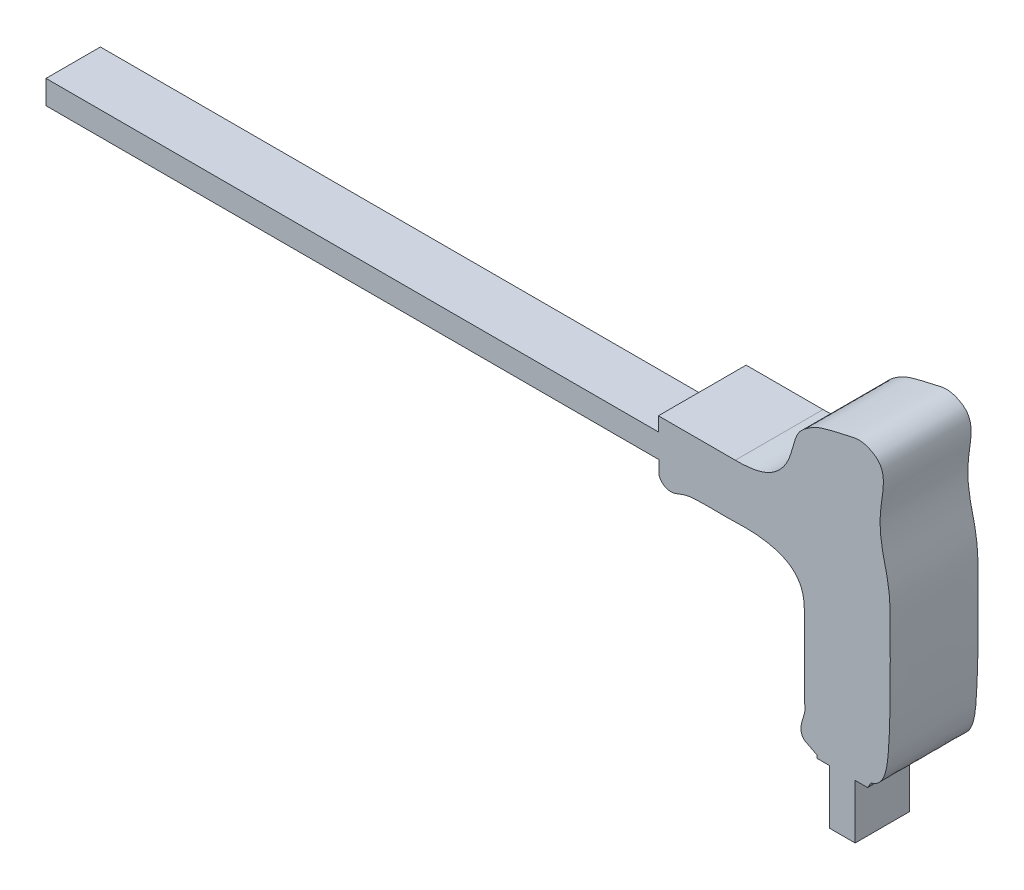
ISO-10303-21;
HEADER;
FILE_DESCRIPTION(('STEP AP214'),'2;1');
FILE_NAME('part.step','',(''),(''),'','','');
FILE_SCHEMA(('AUTOMOTIVE_DESIGN { 1 0 10303 214 1 1 1 1 }'));
ENDSEC;
DATA;
#1=APPLICATION_CONTEXT('core data for automotive mechanical design processes');
#2=APPLICATION_PROTOCOL_DEFINITION('international standard','automotive_design',2000,#1);
#3=PRODUCT_CONTEXT('',#1,'mechanical');
#4=PRODUCT('Part','Part','',(#3));
#5=PRODUCT_RELATED_PRODUCT_CATEGORY('part','',(#4));
#6=PRODUCT_DEFINITION_FORMATION('','',#4);
#7=PRODUCT_DEFINITION_CONTEXT('part definition',#1,'design');
#8=PRODUCT_DEFINITION('design','',#6,#7);
#9=PRODUCT_DEFINITION_SHAPE('','',#8);
#10=(LENGTH_UNIT() NAMED_UNIT(*) SI_UNIT(.MILLI.,.METRE.));
#11=(NAMED_UNIT(*) PLANE_ANGLE_UNIT() SI_UNIT($,.RADIAN.));
#12=(NAMED_UNIT(*) SI_UNIT($,.STERADIAN.) SOLID_ANGLE_UNIT());
#13=UNCERTAINTY_MEASURE_WITH_UNIT(LENGTH_MEASURE(1.E-05),#10,'distance_accuracy_value','');
#14=(GEOMETRIC_REPRESENTATION_CONTEXT(3) GLOBAL_UNCERTAINTY_ASSIGNED_CONTEXT((#13)) GLOBAL_UNIT_ASSIGNED_CONTEXT((#10,
#11,#12)) REPRESENTATION_CONTEXT('',''));
#15=CARTESIAN_POINT('',(0.,0.,0.));
#16=DIRECTION('',(0.,0.,1.));
#17=DIRECTION('',(1.,0.,0.));
#18=AXIS2_PLACEMENT_3D('',#15,#16,#17);
#19=CARTESIAN_POINT('',(249.403808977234,89.7026775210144,-12.5));
#20=DIRECTION('',(0.,0.,-1.));
#21=DIRECTION('',(-1.,0.,0.));
#22=AXIS2_PLACEMENT_3D('',#19,#20,#21);
#23=PLANE('',#22);
#24=DIRECTION('',(0.522562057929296,0.852601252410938,0.));
#25=VECTOR('',#24,1.);
#26=CARTESIAN_POINT('',(246.846245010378,24.4904508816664,-12.5));
#27=LINE('',#26,#25);
#28=CARTESIAN_POINT('',(245.846148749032,22.8587148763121,-12.5));
#29=VERTEX_POINT('',#28);
#30=CARTESIAN_POINT('',(246.846245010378,24.4904508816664,-12.5));
#31=VERTEX_POINT('',#30);
#32=EDGE_CURVE('E261',#29,#31,#27,.T.);
#33=ORIENTED_EDGE('',*,*,#32,.F.);
#34=DIRECTION('',(1.,0.,0.));
#35=VECTOR('',#34,1.);
#36=CARTESIAN_POINT('',(235.073876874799,22.8587148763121,-12.5));
#37=LINE('',#36,#35);
#38=CARTESIAN_POINT('',(231.488323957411,22.8587148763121,-12.5));
#39=VERTEX_POINT('',#38);
#40=EDGE_CURVE('E280',#39,#29,#37,.T.);
#41=ORIENTED_EDGE('',*,*,#40,.F.);
#42=DIRECTION('',(0.,-1.,0.));
#43=VECTOR('',#42,1.);
#44=CARTESIAN_POINT('',(231.488323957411,22.8587148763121,-12.5));
#45=LINE('',#44,#43);
#46=CARTESIAN_POINT('',(231.488323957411,23.6745828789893,-12.5));
#47=VERTEX_POINT('',#46);
#48=EDGE_CURVE('E414',#47,#39,#45,.T.);
#49=ORIENTED_EDGE('',*,*,#48,.F.);
#50=DIRECTION('',(0.891593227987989,-0.452837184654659,0.));
#51=VECTOR('',#50,1.);
#52=CARTESIAN_POINT('',(231.488323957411,23.6745828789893,-12.5));
#53=LINE('',#52,#51);
#54=CARTESIAN_POINT('',(228.065922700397,25.4128089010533,-12.5));
#55=VERTEX_POINT('',#54);
#56=EDGE_CURVE('E406',#55,#47,#53,.T.);
#57=ORIENTED_EDGE('',*,*,#56,.F.);
#58=CARTESIAN_POINT('',(227.857241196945,34.807233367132,-12.5));
#59=CARTESIAN_POINT('',(228.554159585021,32.3711469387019,-12.5));
#60=CARTESIAN_POINT('',(226.189140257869,29.4262759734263,-12.5));
#61=CARTESIAN_POINT('',(227.180498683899,25.9606999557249,-12.5));
#62=CARTESIAN_POINT('',(228.065922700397,25.4128089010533,-12.5));
#63=B_SPLINE_CURVE_WITH_KNOTS('',3,(#58,#59,#60,#61,#62),.UNSPECIFIED.,.F.,.F.,(4,1,4),(0.,
0.703509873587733,1.),.UNSPECIFIED.);
#64=CARTESIAN_POINT('',(227.857241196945,34.807233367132,-12.5));
#65=VERTEX_POINT('',#64);
#66=EDGE_CURVE('E399',#65,#55,#63,.T.);
#67=ORIENTED_EDGE('',*,*,#66,.F.);
#68=DIRECTION('',(0.,-1.,0.));
#69=VECTOR('',#68,1.);
#70=CARTESIAN_POINT('',(227.857241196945,53.8330800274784,-12.5));
#71=LINE('',#70,#69);
#72=CARTESIAN_POINT('',(227.857241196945,53.8330800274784,-12.5));
#73=VERTEX_POINT('',#72);
#74=EDGE_CURVE('E407',#73,#65,#71,.T.);
#75=ORIENTED_EDGE('',*,*,#74,.F.);
#76=CARTESIAN_POINT('',(201.714958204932,69.5182716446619,-12.5));
#77=CARTESIAN_POINT('',(205.529489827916,69.3219352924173,-12.5));
#78=CARTESIAN_POINT('',(211.380523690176,69.9539832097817,-12.5));
#79=CARTESIAN_POINT('',(218.581604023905,68.9657332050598,-12.5));
#80=CARTESIAN_POINT('',(223.046807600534,67.378708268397,-12.5));
#81=CARTESIAN_POINT('',(225.9091814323,64.9714087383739,-12.5));
#82=CARTESIAN_POINT('',(228.190350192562,60.4216522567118,-12.5));
#83=CARTESIAN_POINT('',(227.815743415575,56.4830538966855,-12.5));
#84=CARTESIAN_POINT('',(227.857241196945,53.8330800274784,-12.5));
#85=B_SPLINE_CURVE_WITH_KNOTS('',3,(#76,#77,#78,#79,#80,#81,#82,#83,#84),.UNSPECIFIED.,.F.,.F.,
(4,1,1,1,1,1,4),(0.,0.312765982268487,0.47819065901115,0.591351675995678,0.696911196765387,
0.775100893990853,1.),.UNSPECIFIED.);
#86=CARTESIAN_POINT('',(201.714958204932,69.5182716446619,-12.5));
#87=VERTEX_POINT('',#86);
#88=EDGE_CURVE('E325',#87,#73,#85,.T.);
#89=ORIENTED_EDGE('',*,*,#88,.F.);
#90=CARTESIAN_POINT('',(186.444976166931,70.2259582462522,-12.5));
#91=CARTESIAN_POINT('',(186.830198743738,68.7817302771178,-12.5));
#92=CARTESIAN_POINT('',(189.396498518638,67.2011722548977,-12.5));
#93=CARTESIAN_POINT('',(192.28049529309,68.5329586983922,-12.5));
#94=CARTESIAN_POINT('',(196.136505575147,69.7507859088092,-12.5));
#95=CARTESIAN_POINT('',(199.300789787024,69.4259606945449,-12.5));
#96=CARTESIAN_POINT('',(201.714958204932,69.5182716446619,-12.5));
#97=B_SPLINE_CURVE_WITH_KNOTS('',3,(#90,#91,#92,#93,#94,#95,#96),.UNSPECIFIED.,.F.,.F.,(4,1,1,1,
4),(0.,0.259940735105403,0.446406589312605,0.552011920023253,1.),.UNSPECIFIED.);
#98=CARTESIAN_POINT('',(186.444976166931,70.2259582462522,-12.5));
#99=VERTEX_POINT('',#98);
#100=EDGE_CURVE('E318',#99,#87,#97,.T.);
#101=ORIENTED_EDGE('',*,*,#100,.F.);
#102=DIRECTION('',(0.,-1.,0.));
#103=VECTOR('',#102,1.);
#104=CARTESIAN_POINT('',(186.444976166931,74.0533550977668,-12.5));
#105=LINE('',#104,#103);
#106=CARTESIAN_POINT('',(186.444976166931,74.0533550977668,-12.5));
#107=VERTEX_POINT('',#106);
#108=EDGE_CURVE('E314',#107,#99,#105,.T.);
#109=ORIENTED_EDGE('',*,*,#108,.F.);
#110=DIRECTION('',(-0.0285432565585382,0.999592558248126,0.));
#111=VECTOR('',#110,1.);
#112=CARTESIAN_POINT('',(186.252017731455,80.810811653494,-12.5));
#113=LINE('',#112,#111);
#114=CARTESIAN_POINT('',(186.252017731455,80.810811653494,-12.5));
#115=VERTEX_POINT('',#114);
#116=EDGE_CURVE('E433',#107,#115,#113,.T.);
#117=ORIENTED_EDGE('',*,*,#116,.T.);
#118=DIRECTION('',(0.,-1.,0.));
#119=VECTOR('',#118,1.);
#120=CARTESIAN_POINT('',(186.252017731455,80.810811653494,-12.5));
#121=LINE('',#120,#119);
#122=CARTESIAN_POINT('',(186.252017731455,84.7939748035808,-12.5));
#123=VERTEX_POINT('',#122);
#124=EDGE_CURVE('E311',#123,#115,#121,.T.);
#125=ORIENTED_EDGE('',*,*,#124,.F.);
#126=DIRECTION('',(-1.,0.,0.));
#127=VECTOR('',#126,1.);
#128=CARTESIAN_POINT('',(186.252017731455,84.7939748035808,-12.5));
#129=LINE('',#128,#127);
#130=CARTESIAN_POINT('',(208.169740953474,84.7939748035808,-12.5));
#131=VERTEX_POINT('',#130);
#132=EDGE_CURVE('E254',#131,#123,#129,.T.);
#133=ORIENTED_EDGE('',*,*,#132,.F.);
#134=CARTESIAN_POINT('',(246.846245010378,24.4904508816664,-12.5));
#135=CARTESIAN_POINT('',(249.541350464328,25.1449536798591,-12.5));
#136=CARTESIAN_POINT('',(251.321750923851,29.1759371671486,-12.5));
#137=CARTESIAN_POINT('',(252.006376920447,36.8949120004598,-12.5));
#138=CARTESIAN_POINT('',(252.279225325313,44.9508019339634,-12.5));
#139=CARTESIAN_POINT('',(252.375111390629,53.5484908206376,-12.5));
#140=CARTESIAN_POINT('',(252.249628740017,62.1713813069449,-12.5));
#141=CARTESIAN_POINT('',(252.489052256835,69.7244205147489,-12.5));
#142=CARTESIAN_POINT('',(251.73363636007,76.6308254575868,-12.5));
#143=CARTESIAN_POINT('',(250.455225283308,81.5328226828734,-12.5));
#144=CARTESIAN_POINT('',(249.485743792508,86.5917521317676,-12.5));
#145=CARTESIAN_POINT('',(249.27625752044,91.8665258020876,-12.5));
#146=CARTESIAN_POINT('',(250.051953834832,96.3900079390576,-12.5));
#147=CARTESIAN_POINT('',(250.444664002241,100.175824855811,-12.5));
#148=CARTESIAN_POINT('',(250.2170714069,102.968126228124,-12.5));
#149=CARTESIAN_POINT('',(248.994135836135,105.182106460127,-12.5));
#150=CARTESIAN_POINT('',(246.715346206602,106.717748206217,-12.5));
#151=CARTESIAN_POINT('',(243.634586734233,107.700482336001,-12.5));
#152=CARTESIAN_POINT('',(239.956695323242,106.79386594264,-12.5));
#153=CARTESIAN_POINT('',(236.424450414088,106.030582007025,-12.5));
#154=CARTESIAN_POINT('',(233.426238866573,105.239518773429,-12.5));
#155=CARTESIAN_POINT('',(230.830750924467,104.325102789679,-12.5));
#156=CARTESIAN_POINT('',(228.687748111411,102.997570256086,-12.5));
#157=CARTESIAN_POINT('',(226.196774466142,100.990119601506,-12.5));
#158=CARTESIAN_POINT('',(224.888427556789,97.7799214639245,-12.5));
#159=CARTESIAN_POINT('',(224.059332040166,94.0599027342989,-12.5));
#160=CARTESIAN_POINT('',(222.148266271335,89.802209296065,-12.5));
#161=CARTESIAN_POINT('',(217.031270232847,85.2220023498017,-12.5));
#162=CARTESIAN_POINT('',(211.440919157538,84.799959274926,-12.5));
#163=CARTESIAN_POINT('',(208.169740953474,84.7939748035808,-12.5));
#164=B_SPLINE_CURVE_WITH_KNOTS('',3,(#134,#135,#136,#137,#138,#139,#140,#141,#142,#143,#144,
#145,#146,#147,#148,#149,#150,#151,#152,#153,#154,#155,#156,#157,#158,#159,#160,#161,#162,#163),
.UNSPECIFIED.,.F.,.F.,(4,1,1,1,1,1,1,1,1,1,1,1,1,1,1,1,1,1,1,1,1,1,1,1,1,1,1,4),(0.,
0.0540989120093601,0.0903756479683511,0.173806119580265,0.233113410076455,0.282095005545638,
0.365979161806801,0.401251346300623,0.436426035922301,0.478744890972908,0.515881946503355,
0.553282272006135,0.580679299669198,0.600836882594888,0.614477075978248,0.6354896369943,
0.660553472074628,0.683931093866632,0.718081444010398,0.74170176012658,0.752892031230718,
0.779260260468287,0.797612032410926,0.822984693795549,0.854013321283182,0.883148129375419,
0.925552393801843,1.),.UNSPECIFIED.);
#165=EDGE_CURVE('E257',#31,#131,#164,.T.);
#166=ORIENTED_EDGE('',*,*,#165,.F.);
#167=EDGE_LOOP('',(#33,#41,#49,#57,#67,#75,#89,#101,#109,#117,#125,#133,#166));
#168=FACE_BOUND('',#167,.T.);
#169=ADVANCED_FACE('F39',(#168),#23,.T.);
#170=CARTESIAN_POINT('',(186.252017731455,80.810811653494,-12.5));
#171=DIRECTION('',(-1.,0.,0.));
#172=DIRECTION('',(0.,0.,1.));
#173=AXIS2_PLACEMENT_3D('',#170,#171,#172);
#174=PLANE('',#173);
#175=DIRECTION('',(0.,0.,1.));
#176=VECTOR('',#175,1.);
#177=CARTESIAN_POINT('',(186.252017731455,80.810811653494,-12.5));
#178=LINE('',#177,#176);
#179=CARTESIAN_POINT('',(186.252017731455,80.810811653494,-3.));
#180=VERTEX_POINT('',#179);
#181=EDGE_CURVE('E43',#115,#180,#178,.T.);
#182=ORIENTED_EDGE('',*,*,#181,.T.);
#183=CARTESIAN_POINT('',(186.252017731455,80.810811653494,12.5));
#184=VERTEX_POINT('',#183);
#185=EDGE_CURVE('E252',#180,#184,#178,.T.);
#186=ORIENTED_EDGE('',*,*,#185,.T.);
#187=DIRECTION('',(0.,-1.,0.));
#188=VECTOR('',#187,1.);
#189=CARTESIAN_POINT('',(186.252017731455,80.810811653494,12.5));
#190=LINE('',#189,#188);
#191=CARTESIAN_POINT('',(186.252017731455,84.7939748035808,12.5));
#192=VERTEX_POINT('',#191);
#193=EDGE_CURVE('E422',#192,#184,#190,.T.);
#194=ORIENTED_EDGE('',*,*,#193,.F.);
#195=DIRECTION('',(0.,0.,1.));
#196=VECTOR('',#195,1.);
#197=CARTESIAN_POINT('',(186.252017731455,84.7939748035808,-12.5));
#198=LINE('',#197,#196);
#199=EDGE_CURVE('E11',#123,#192,#198,.T.);
#200=ORIENTED_EDGE('',*,*,#199,.F.);
#201=ORIENTED_EDGE('',*,*,#124,.T.);
#202=EDGE_LOOP('',(#182,#186,#194,#200,#201));
#203=FACE_BOUND('',#202,.T.);
#204=ADVANCED_FACE('F41',(#203),#174,.T.);
#205=CARTESIAN_POINT('',(186.252017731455,84.7939748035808,-12.5));
#206=DIRECTION('',(0.,1.,0.));
#207=DIRECTION('',(0.,0.,1.));
#208=AXIS2_PLACEMENT_3D('',#205,#206,#207);
#209=PLANE('',#208);
#210=ORIENTED_EDGE('',*,*,#199,.T.);
#211=DIRECTION('',(-1.,0.,0.));
#212=VECTOR('',#211,1.);
#213=CARTESIAN_POINT('',(186.252017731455,84.7939748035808,12.5));
#214=LINE('',#213,#212);
#215=CARTESIAN_POINT('',(208.169740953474,84.7939748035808,12.5));
#216=VERTEX_POINT('',#215);
#217=EDGE_CURVE('E299',#216,#192,#214,.T.);
#218=ORIENTED_EDGE('',*,*,#217,.F.);
#219=DIRECTION('',(0.,0.,1.));
#220=VECTOR('',#219,1.);
#221=CARTESIAN_POINT('',(208.169740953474,84.7939748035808,-12.5));
#222=LINE('',#221,#220);
#223=EDGE_CURVE('E49',#131,#216,#222,.T.);
#224=ORIENTED_EDGE('',*,*,#223,.F.);
#225=ORIENTED_EDGE('',*,*,#132,.T.);
#226=EDGE_LOOP('',(#210,#218,#224,#225));
#227=FACE_BOUND('',#226,.T.);
#228=ADVANCED_FACE('F365',(#227),#209,.T.);
#229=DIRECTION('',(0.,0.,1.));
#230=VECTOR('',#229,1.);
#231=SURFACE_OF_LINEAR_EXTRUSION('',#164,#230);
#232=ORIENTED_EDGE('',*,*,#223,.T.);
#233=CARTESIAN_POINT('',(246.846245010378,24.4904508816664,12.5));
#234=CARTESIAN_POINT('',(249.541350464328,25.1449536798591,12.5));
#235=CARTESIAN_POINT('',(251.321750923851,29.1759371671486,12.5));
#236=CARTESIAN_POINT('',(252.006376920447,36.8949120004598,12.5));
#237=CARTESIAN_POINT('',(252.279225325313,44.9508019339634,12.5));
#238=CARTESIAN_POINT('',(252.375111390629,53.5484908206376,12.5));
#239=CARTESIAN_POINT('',(252.249628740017,62.1713813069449,12.5));
#240=CARTESIAN_POINT('',(252.489052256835,69.7244205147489,12.5));
#241=CARTESIAN_POINT('',(251.73363636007,76.6308254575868,12.5));
#242=CARTESIAN_POINT('',(250.455225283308,81.5328226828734,12.5));
#243=CARTESIAN_POINT('',(249.485743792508,86.5917521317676,12.5));
#244=CARTESIAN_POINT('',(249.27625752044,91.8665258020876,12.5));
#245=CARTESIAN_POINT('',(250.051953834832,96.3900079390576,12.5));
#246=CARTESIAN_POINT('',(250.444664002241,100.175824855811,12.5));
#247=CARTESIAN_POINT('',(250.2170714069,102.968126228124,12.5));
#248=CARTESIAN_POINT('',(248.994135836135,105.182106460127,12.5));
#249=CARTESIAN_POINT('',(246.715346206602,106.717748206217,12.5));
#250=CARTESIAN_POINT('',(243.634586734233,107.700482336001,12.5));
#251=CARTESIAN_POINT('',(239.956695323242,106.79386594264,12.5));
#252=CARTESIAN_POINT('',(236.424450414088,106.030582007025,12.5));
#253=CARTESIAN_POINT('',(233.426238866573,105.239518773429,12.5));
#254=CARTESIAN_POINT('',(230.830750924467,104.325102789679,12.5));
#255=CARTESIAN_POINT('',(228.687748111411,102.997570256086,12.5));
#256=CARTESIAN_POINT('',(226.196774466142,100.990119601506,12.5));
#257=CARTESIAN_POINT('',(224.888427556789,97.7799214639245,12.5));
#258=CARTESIAN_POINT('',(224.059332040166,94.0599027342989,12.5));
#259=CARTESIAN_POINT('',(222.148266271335,89.802209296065,12.5));
#260=CARTESIAN_POINT('',(217.031270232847,85.2220023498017,12.5));
#261=CARTESIAN_POINT('',(211.440919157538,84.799959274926,12.5));
#262=CARTESIAN_POINT('',(208.169740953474,84.7939748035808,12.5));
#263=B_SPLINE_CURVE_WITH_KNOTS('',3,(#233,#234,#235,#236,#237,#238,#239,#240,#241,#242,#243,
#244,#245,#246,#247,#248,#249,#250,#251,#252,#253,#254,#255,#256,#257,#258,#259,#260,#261,#262),
.UNSPECIFIED.,.F.,.F.,(4,1,1,1,1,1,1,1,1,1,1,1,1,1,1,1,1,1,1,1,1,1,1,1,1,1,1,4),(0.,
0.0540989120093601,0.0903756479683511,0.173806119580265,0.233113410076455,0.282095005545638,
0.365979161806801,0.401251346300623,0.436426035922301,0.478744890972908,0.515881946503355,
0.553282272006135,0.580679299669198,0.600836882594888,0.614477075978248,0.6354896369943,
0.660553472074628,0.683931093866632,0.718081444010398,0.74170176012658,0.752892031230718,
0.779260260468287,0.797612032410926,0.822984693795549,0.854013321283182,0.883148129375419,
0.925552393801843,1.),.UNSPECIFIED.);
#264=CARTESIAN_POINT('',(246.846245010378,24.4904508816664,12.5));
#265=VERTEX_POINT('',#264);
#266=EDGE_CURVE('E296',#265,#216,#263,.T.);
#267=ORIENTED_EDGE('',*,*,#266,.F.);
#268=DIRECTION('',(0.,0.,1.));
#269=VECTOR('',#268,1.);
#270=CARTESIAN_POINT('',(246.846245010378,24.4904508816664,-12.5));
#271=LINE('',#270,#269);
#272=EDGE_CURVE('E270',#31,#265,#271,.T.);
#273=ORIENTED_EDGE('',*,*,#272,.F.);
#274=ORIENTED_EDGE('',*,*,#165,.T.);
#275=EDGE_LOOP('',(#232,#267,#273,#274));
#276=FACE_BOUND('',#275,.T.);
#277=ADVANCED_FACE('F370',(#276),#231,.T.);
#278=CARTESIAN_POINT('',(246.846245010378,24.4904508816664,-12.5));
#279=DIRECTION('',(0.852601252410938,-0.522562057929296,0.));
#280=DIRECTION('',(0.522562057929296,0.852601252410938,0.));
#281=AXIS2_PLACEMENT_3D('',#278,#279,#280);
#282=PLANE('',#281);
#283=ORIENTED_EDGE('',*,*,#272,.T.);
#284=DIRECTION('',(0.522562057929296,0.852601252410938,0.));
#285=VECTOR('',#284,1.);
#286=CARTESIAN_POINT('',(246.846245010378,24.4904508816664,12.5));
#287=LINE('',#286,#285);
#288=CARTESIAN_POINT('',(245.846148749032,22.8587148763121,12.5));
#289=VERTEX_POINT('',#288);
#290=EDGE_CURVE('E290',#289,#265,#287,.T.);
#291=ORIENTED_EDGE('',*,*,#290,.F.);
#292=DIRECTION('',(0.,0.,1.));
#293=VECTOR('',#292,1.);
#294=CARTESIAN_POINT('',(245.846148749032,22.8587148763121,-12.5));
#295=LINE('',#294,#293);
#296=EDGE_CURVE('E208',#29,#289,#295,.T.);
#297=ORIENTED_EDGE('',*,*,#296,.F.);
#298=ORIENTED_EDGE('',*,*,#32,.T.);
#299=EDGE_LOOP('',(#283,#291,#297,#298));
#300=FACE_BOUND('',#299,.T.);
#301=ADVANCED_FACE('F294',(#300),#282,.T.);
#302=CARTESIAN_POINT('',(245.846148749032,22.8587148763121,-12.5));
#303=DIRECTION('',(0.,-1.,0.));
#304=DIRECTION('',(0.,0.,-1.));
#305=AXIS2_PLACEMENT_3D('',#302,#303,#304);
#306=PLANE('',#305);
#307=ORIENTED_EDGE('',*,*,#296,.T.);
#308=DIRECTION('',(1.,0.,0.));
#309=VECTOR('',#308,1.);
#310=CARTESIAN_POINT('',(245.846148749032,22.8587148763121,12.5));
#311=LINE('',#310,#309);
#312=CARTESIAN_POINT('',(242.319493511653,22.8587148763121,12.5));
#313=VERTEX_POINT('',#312);
#314=EDGE_CURVE('E278',#313,#289,#311,.T.);
#315=ORIENTED_EDGE('',*,*,#314,.F.);
#316=DIRECTION('',(0.,0.,1.));
#317=VECTOR('',#316,1.);
#318=CARTESIAN_POINT('',(242.319493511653,22.8587148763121,-12.5));
#319=LINE('',#318,#317);
#320=CARTESIAN_POINT('',(242.319493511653,22.8587148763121,-3.));
#321=VERTEX_POINT('',#320);
#322=EDGE_CURVE('E204',#321,#313,#319,.T.);
#323=ORIENTED_EDGE('',*,*,#322,.F.);
#324=DIRECTION('',(-1.,0.,0.));
#325=VECTOR('',#324,1.);
#326=CARTESIAN_POINT('',(235.073876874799,22.8587148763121,-3.));
#327=LINE('',#326,#325);
#328=CARTESIAN_POINT('',(235.073876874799,22.8587148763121,-3.));
#329=VERTEX_POINT('',#328);
#330=EDGE_CURVE('E183',#321,#329,#327,.T.);
#331=ORIENTED_EDGE('',*,*,#330,.T.);
#332=DIRECTION('',(0.,0.,1.));
#333=VECTOR('',#332,1.);
#334=CARTESIAN_POINT('',(235.073876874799,22.8587148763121,-12.5));
#335=LINE('',#334,#333);
#336=CARTESIAN_POINT('',(235.073876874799,22.8587148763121,12.5));
#337=VERTEX_POINT('',#336);
#338=EDGE_CURVE('E210',#329,#337,#335,.T.);
#339=ORIENTED_EDGE('',*,*,#338,.T.);
#340=DIRECTION('',(1.,0.,0.));
#341=VECTOR('',#340,1.);
#342=CARTESIAN_POINT('',(235.073876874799,22.8587148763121,12.5));
#343=LINE('',#342,#341);
#344=CARTESIAN_POINT('',(231.488323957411,22.8587148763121,12.5));
#345=VERTEX_POINT('',#344);
#346=EDGE_CURVE('E486',#345,#337,#343,.T.);
#347=ORIENTED_EDGE('',*,*,#346,.F.);
#348=DIRECTION('',(0.,0.,1.));
#349=VECTOR('',#348,1.);
#350=CARTESIAN_POINT('',(231.488323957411,22.8587148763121,-12.5));
#351=LINE('',#350,#349);
#352=EDGE_CURVE('E216',#39,#345,#351,.T.);
#353=ORIENTED_EDGE('',*,*,#352,.F.);
#354=ORIENTED_EDGE('',*,*,#40,.T.);
#355=EDGE_LOOP('',(#307,#315,#323,#331,#339,#347,#353,#354));
#356=FACE_BOUND('',#355,.T.);
#357=ADVANCED_FACE('F277',(#356),#306,.T.);
#358=CARTESIAN_POINT('',(242.319493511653,22.8587148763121,-12.5));
#359=DIRECTION('',(1.,0.,0.));
#360=DIRECTION('',(0.,0.,-1.));
#361=AXIS2_PLACEMENT_3D('',#358,#359,#360);
#362=PLANE('',#361);
#363=DIRECTION('',(0.,1.,0.));
#364=VECTOR('',#363,1.);
#365=CARTESIAN_POINT('',(242.319493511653,7.39849725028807,-3.));
#366=LINE('',#365,#364);
#367=CARTESIAN_POINT('',(242.319493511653,7.39849725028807,-3.));
#368=VERTEX_POINT('',#367);
#369=EDGE_CURVE('E177',#368,#321,#366,.T.);
#370=ORIENTED_EDGE('',*,*,#369,.T.);
#371=ORIENTED_EDGE('',*,*,#322,.T.);
#372=DIRECTION('',(0.,1.,0.));
#373=VECTOR('',#372,1.);
#374=CARTESIAN_POINT('',(242.319493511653,22.8587148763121,12.5));
#375=LINE('',#374,#373);
#376=CARTESIAN_POINT('',(242.319493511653,7.39849725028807,12.5));
#377=VERTEX_POINT('',#376);
#378=EDGE_CURVE('E202',#377,#313,#375,.T.);
#379=ORIENTED_EDGE('',*,*,#378,.F.);
#380=DIRECTION('',(0.,0.,1.));
#381=VECTOR('',#380,1.);
#382=CARTESIAN_POINT('',(242.319493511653,7.39849725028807,-12.5));
#383=LINE('',#382,#381);
#384=EDGE_CURVE('E193',#368,#377,#383,.T.);
#385=ORIENTED_EDGE('',*,*,#384,.F.);
#386=EDGE_LOOP('',(#370,#371,#379,#385));
#387=FACE_BOUND('',#386,.T.);
#388=ADVANCED_FACE('F200',(#387),#362,.T.);
#389=CARTESIAN_POINT('',(242.319493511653,7.39849725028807,-12.5));
#390=DIRECTION('',(0.,-1.,0.));
#391=DIRECTION('',(0.,0.,-1.));
#392=AXIS2_PLACEMENT_3D('',#389,#390,#391);
#393=PLANE('',#392);
#394=DIRECTION('',(1.,0.,0.));
#395=VECTOR('',#394,1.);
#396=CARTESIAN_POINT('',(235.073876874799,7.39849725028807,-3.));
#397=LINE('',#396,#395);
#398=CARTESIAN_POINT('',(235.073876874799,7.39849725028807,-3.));
#399=VERTEX_POINT('',#398);
#400=EDGE_CURVE('E181',#399,#368,#397,.T.);
#401=ORIENTED_EDGE('',*,*,#400,.T.);
#402=ORIENTED_EDGE('',*,*,#384,.T.);
#403=DIRECTION('',(1.,0.,0.));
#404=VECTOR('',#403,1.);
#405=CARTESIAN_POINT('',(242.319493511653,7.39849725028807,12.5));
#406=LINE('',#405,#404);
#407=CARTESIAN_POINT('',(235.073876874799,7.39849725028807,12.5));
#408=VERTEX_POINT('',#407);
#409=EDGE_CURVE('E494',#408,#377,#406,.T.);
#410=ORIENTED_EDGE('',*,*,#409,.F.);
#411=DIRECTION('',(0.,0.,1.));
#412=VECTOR('',#411,1.);
#413=CARTESIAN_POINT('',(235.073876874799,7.39849725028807,-12.5));
#414=LINE('',#413,#412);
#415=EDGE_CURVE('E195',#399,#408,#414,.T.);
#416=ORIENTED_EDGE('',*,*,#415,.F.);
#417=EDGE_LOOP('',(#401,#402,#410,#416));
#418=FACE_BOUND('',#417,.T.);
#419=ADVANCED_FACE('F191',(#418),#393,.T.);
#420=CARTESIAN_POINT('',(235.073876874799,7.39849725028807,-12.5));
#421=DIRECTION('',(-1.,0.,0.));
#422=DIRECTION('',(0.,0.,1.));
#423=AXIS2_PLACEMENT_3D('',#420,#421,#422);
#424=PLANE('',#423);
#425=DIRECTION('',(0.,-1.,0.));
#426=VECTOR('',#425,1.);
#427=CARTESIAN_POINT('',(235.073876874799,22.8587148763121,-3.));
#428=LINE('',#427,#426);
#429=EDGE_CURVE('E425',#329,#399,#428,.T.);
#430=ORIENTED_EDGE('',*,*,#429,.T.);
#431=ORIENTED_EDGE('',*,*,#415,.T.);
#432=DIRECTION('',(0.,-1.,0.));
#433=VECTOR('',#432,1.);
#434=CARTESIAN_POINT('',(235.073876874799,7.39849725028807,12.5));
#435=LINE('',#434,#433);
#436=EDGE_CURVE('E490',#337,#408,#435,.T.);
#437=ORIENTED_EDGE('',*,*,#436,.F.);
#438=ORIENTED_EDGE('',*,*,#338,.F.);
#439=EDGE_LOOP('',(#430,#431,#437,#438));
#440=FACE_BOUND('',#439,.T.);
#441=ADVANCED_FACE('F382',(#440),#424,.T.);
#442=CARTESIAN_POINT('',(231.488323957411,22.8587148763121,-12.5));
#443=DIRECTION('',(-1.,0.,0.));
#444=DIRECTION('',(0.,0.,1.));
#445=AXIS2_PLACEMENT_3D('',#442,#443,#444);
#446=PLANE('',#445);
#447=ORIENTED_EDGE('',*,*,#352,.T.);
#448=DIRECTION('',(0.,-1.,0.));
#449=VECTOR('',#448,1.);
#450=CARTESIAN_POINT('',(231.488323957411,22.8587148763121,12.5));
#451=LINE('',#450,#449);
#452=CARTESIAN_POINT('',(231.488323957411,23.6745828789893,12.5));
#453=VERTEX_POINT('',#452);
#454=EDGE_CURVE('E482',#453,#345,#451,.T.);
#455=ORIENTED_EDGE('',*,*,#454,.F.);
#456=DIRECTION('',(0.,0.,1.));
#457=VECTOR('',#456,1.);
#458=CARTESIAN_POINT('',(231.488323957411,23.6745828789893,-12.5));
#459=LINE('',#458,#457);
#460=EDGE_CURVE('E219',#47,#453,#459,.T.);
#461=ORIENTED_EDGE('',*,*,#460,.F.);
#462=ORIENTED_EDGE('',*,*,#48,.T.);
#463=EDGE_LOOP('',(#447,#455,#461,#462));
#464=FACE_BOUND('',#463,.T.);
#465=ADVANCED_FACE('F385',(#464),#446,.T.);
#466=CARTESIAN_POINT('',(231.488323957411,23.6745828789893,-12.5));
#467=DIRECTION('',(-0.452837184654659,-0.891593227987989,0.));
#468=DIRECTION('',(0.891593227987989,-0.452837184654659,0.));
#469=AXIS2_PLACEMENT_3D('',#466,#467,#468);
#470=PLANE('',#469);
#471=ORIENTED_EDGE('',*,*,#460,.T.);
#472=DIRECTION('',(0.891593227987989,-0.452837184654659,0.));
#473=VECTOR('',#472,1.);
#474=CARTESIAN_POINT('',(231.488323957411,23.6745828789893,12.5));
#475=LINE('',#474,#473);
#476=CARTESIAN_POINT('',(228.065922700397,25.4128089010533,12.5));
#477=VERTEX_POINT('',#476);
#478=EDGE_CURVE('E475',#477,#453,#475,.T.);
#479=ORIENTED_EDGE('',*,*,#478,.F.);
#480=DIRECTION('',(0.,0.,1.));
#481=VECTOR('',#480,1.);
#482=CARTESIAN_POINT('',(228.065922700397,25.4128089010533,-12.5));
#483=LINE('',#482,#481);
#484=EDGE_CURVE('E222',#55,#477,#483,.T.);
#485=ORIENTED_EDGE('',*,*,#484,.F.);
#486=ORIENTED_EDGE('',*,*,#56,.T.);
#487=EDGE_LOOP('',(#471,#479,#485,#486));
#488=FACE_BOUND('',#487,.T.);
#489=ADVANCED_FACE('F389',(#488),#470,.T.);
#490=DIRECTION('',(0.,0.,1.));
#491=VECTOR('',#490,1.);
#492=SURFACE_OF_LINEAR_EXTRUSION('',#63,#491);
#493=ORIENTED_EDGE('',*,*,#484,.T.);
#494=CARTESIAN_POINT('',(227.857241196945,34.807233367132,12.5));
#495=CARTESIAN_POINT('',(228.554159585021,32.3711469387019,12.5));
#496=CARTESIAN_POINT('',(226.189140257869,29.4262759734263,12.5));
#497=CARTESIAN_POINT('',(227.180498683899,25.9606999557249,12.5));
#498=CARTESIAN_POINT('',(228.065922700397,25.4128089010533,12.5));
#499=B_SPLINE_CURVE_WITH_KNOTS('',3,(#494,#495,#496,#497,#498),.UNSPECIFIED.,.F.,.F.,(4,1,4),
(0.,0.703509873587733,1.),.UNSPECIFIED.);
#500=CARTESIAN_POINT('',(227.857241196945,34.807233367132,12.5));
#501=VERTEX_POINT('',#500);
#502=EDGE_CURVE('E469',#501,#477,#499,.T.);
#503=ORIENTED_EDGE('',*,*,#502,.F.);
#504=DIRECTION('',(0.,0.,1.));
#505=VECTOR('',#504,1.);
#506=CARTESIAN_POINT('',(227.857241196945,34.807233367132,-12.5));
#507=LINE('',#506,#505);
#508=EDGE_CURVE('E225',#65,#501,#507,.T.);
#509=ORIENTED_EDGE('',*,*,#508,.F.);
#510=ORIENTED_EDGE('',*,*,#66,.T.);
#511=EDGE_LOOP('',(#493,#503,#509,#510));
#512=FACE_BOUND('',#511,.T.);
#513=ADVANCED_FACE('F393',(#512),#492,.T.);
#514=CARTESIAN_POINT('',(227.857241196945,53.8330800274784,-12.5));
#515=DIRECTION('',(-1.,0.,0.));
#516=DIRECTION('',(0.,0.,1.));
#517=AXIS2_PLACEMENT_3D('',#514,#515,#516);
#518=PLANE('',#517);
#519=ORIENTED_EDGE('',*,*,#508,.T.);
#520=DIRECTION('',(0.,-1.,0.));
#521=VECTOR('',#520,1.);
#522=CARTESIAN_POINT('',(227.857241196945,53.8330800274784,12.5));
#523=LINE('',#522,#521);
#524=CARTESIAN_POINT('',(227.857241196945,53.8330800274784,12.5));
#525=VERTEX_POINT('',#524);
#526=EDGE_CURVE('E462',#525,#501,#523,.T.);
#527=ORIENTED_EDGE('',*,*,#526,.F.);
#528=DIRECTION('',(0.,0.,1.));
#529=VECTOR('',#528,1.);
#530=CARTESIAN_POINT('',(227.857241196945,53.8330800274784,-12.5));
#531=LINE('',#530,#529);
#532=EDGE_CURVE('E228',#73,#525,#531,.T.);
#533=ORIENTED_EDGE('',*,*,#532,.F.);
#534=ORIENTED_EDGE('',*,*,#74,.T.);
#535=EDGE_LOOP('',(#519,#527,#533,#534));
#536=FACE_BOUND('',#535,.T.);
#537=ADVANCED_FACE('F397',(#536),#518,.T.);
#538=DIRECTION('',(0.,0.,1.));
#539=VECTOR('',#538,1.);
#540=SURFACE_OF_LINEAR_EXTRUSION('',#85,#539);
#541=ORIENTED_EDGE('',*,*,#532,.T.);
#542=CARTESIAN_POINT('',(201.714958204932,69.5182716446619,12.5));
#543=CARTESIAN_POINT('',(205.529489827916,69.3219352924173,12.5));
#544=CARTESIAN_POINT('',(211.380523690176,69.9539832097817,12.5));
#545=CARTESIAN_POINT('',(218.581604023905,68.9657332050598,12.5));
#546=CARTESIAN_POINT('',(223.046807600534,67.378708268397,12.5));
#547=CARTESIAN_POINT('',(225.9091814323,64.9714087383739,12.5));
#548=CARTESIAN_POINT('',(228.190350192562,60.4216522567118,12.5));
#549=CARTESIAN_POINT('',(227.815743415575,56.4830538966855,12.5));
#550=CARTESIAN_POINT('',(227.857241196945,53.8330800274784,12.5));
#551=B_SPLINE_CURVE_WITH_KNOTS('',3,(#542,#543,#544,#545,#546,#547,#548,#549,#550),
.UNSPECIFIED.,.F.,.F.,(4,1,1,1,1,1,4),(0.,0.312765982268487,0.47819065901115,0.591351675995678,
0.696911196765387,0.775100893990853,1.),.UNSPECIFIED.);
#552=CARTESIAN_POINT('',(201.714958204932,69.5182716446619,12.5));
#553=VERTEX_POINT('',#552);
#554=EDGE_CURVE('E453',#553,#525,#551,.T.);
#555=ORIENTED_EDGE('',*,*,#554,.F.);
#556=DIRECTION('',(0.,0.,1.));
#557=VECTOR('',#556,1.);
#558=CARTESIAN_POINT('',(201.714958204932,69.5182716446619,-12.5));
#559=LINE('',#558,#557);
#560=EDGE_CURVE('E231',#87,#553,#559,.T.);
#561=ORIENTED_EDGE('',*,*,#560,.F.);
#562=ORIENTED_EDGE('',*,*,#88,.T.);
#563=EDGE_LOOP('',(#541,#555,#561,#562));
#564=FACE_BOUND('',#563,.T.);
#565=ADVANCED_FACE('F339',(#564),#540,.T.);
#566=DIRECTION('',(0.,0.,1.));
#567=VECTOR('',#566,1.);
#568=SURFACE_OF_LINEAR_EXTRUSION('',#97,#567);
#569=ORIENTED_EDGE('',*,*,#560,.T.);
#570=CARTESIAN_POINT('',(186.444976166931,70.2259582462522,12.5));
#571=CARTESIAN_POINT('',(186.830198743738,68.7817302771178,12.5));
#572=CARTESIAN_POINT('',(189.396498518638,67.2011722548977,12.5));
#573=CARTESIAN_POINT('',(192.28049529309,68.5329586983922,12.5));
#574=CARTESIAN_POINT('',(196.136505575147,69.7507859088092,12.5));
#575=CARTESIAN_POINT('',(199.300789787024,69.4259606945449,12.5));
#576=CARTESIAN_POINT('',(201.714958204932,69.5182716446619,12.5));
#577=B_SPLINE_CURVE_WITH_KNOTS('',3,(#570,#571,#572,#573,#574,#575,#576),.UNSPECIFIED.,.F.,.F.,
(4,1,1,1,4),(0.,0.259940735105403,0.446406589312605,0.552011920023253,1.),.UNSPECIFIED.);
#578=CARTESIAN_POINT('',(186.444976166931,70.2259582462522,12.5));
#579=VERTEX_POINT('',#578);
#580=EDGE_CURVE('E447',#579,#553,#577,.T.);
#581=ORIENTED_EDGE('',*,*,#580,.F.);
#582=DIRECTION('',(0.,0.,1.));
#583=VECTOR('',#582,1.);
#584=CARTESIAN_POINT('',(186.444976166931,70.2259582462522,-12.5));
#585=LINE('',#584,#583);
#586=EDGE_CURVE('E234',#99,#579,#585,.T.);
#587=ORIENTED_EDGE('',*,*,#586,.F.);
#588=ORIENTED_EDGE('',*,*,#100,.T.);
#589=EDGE_LOOP('',(#569,#581,#587,#588));
#590=FACE_BOUND('',#589,.T.);
#591=ADVANCED_FACE('F334',(#590),#568,.T.);
#592=CARTESIAN_POINT('',(186.444976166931,74.0533550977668,-12.5));
#593=DIRECTION('',(-1.,0.,0.));
#594=DIRECTION('',(0.,0.,1.));
#595=AXIS2_PLACEMENT_3D('',#592,#593,#594);
#596=PLANE('',#595);
#597=ORIENTED_EDGE('',*,*,#586,.T.);
#598=DIRECTION('',(0.,-1.,0.));
#599=VECTOR('',#598,1.);
#600=CARTESIAN_POINT('',(186.444976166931,74.0533550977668,12.5));
#601=LINE('',#600,#599);
#602=CARTESIAN_POINT('',(186.444976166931,74.0533550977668,12.5));
#603=VERTEX_POINT('',#602);
#604=EDGE_CURVE('E443',#603,#579,#601,.T.);
#605=ORIENTED_EDGE('',*,*,#604,.F.);
#606=DIRECTION('',(0.,0.,1.));
#607=VECTOR('',#606,1.);
#608=CARTESIAN_POINT('',(186.444976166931,74.0533550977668,-12.5));
#609=LINE('',#608,#607);
#610=CARTESIAN_POINT('',(186.444976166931,74.0533550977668,-3.));
#611=VERTEX_POINT('',#610);
#612=EDGE_CURVE('E240',#611,#603,#609,.T.);
#613=ORIENTED_EDGE('',*,*,#612,.F.);
#614=EDGE_CURVE('E237',#107,#611,#609,.T.);
#615=ORIENTED_EDGE('',*,*,#614,.F.);
#616=ORIENTED_EDGE('',*,*,#108,.T.);
#617=EDGE_LOOP('',(#597,#605,#613,#615,#616));
#618=FACE_BOUND('',#617,.T.);
#619=ADVANCED_FACE('F338',(#618),#596,.T.);
#620=CARTESIAN_POINT('',(11.7691688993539,74.0533550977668,-12.5));
#621=DIRECTION('',(0.,-1.,0.));
#622=DIRECTION('',(0.,0.,-1.));
#623=AXIS2_PLACEMENT_3D('',#620,#621,#622);
#624=PLANE('',#623);
#625=DIRECTION('',(1.,0.,0.));
#626=VECTOR('',#625,1.);
#627=CARTESIAN_POINT('',(11.7691688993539,74.0533550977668,-3.));
#628=LINE('',#627,#626);
#629=CARTESIAN_POINT('',(11.7691688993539,74.0533550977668,-3.));
#630=VERTEX_POINT('',#629);
#631=EDGE_CURVE('E507',#630,#611,#628,.T.);
#632=ORIENTED_EDGE('',*,*,#631,.T.);
#633=ORIENTED_EDGE('',*,*,#612,.T.);
#634=DIRECTION('',(1.,0.,0.));
#635=VECTOR('',#634,1.);
#636=CARTESIAN_POINT('',(11.7691688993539,74.0533550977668,12.5));
#637=LINE('',#636,#635);
#638=CARTESIAN_POINT('',(11.7691688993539,74.0533550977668,12.5));
#639=VERTEX_POINT('',#638);
#640=EDGE_CURVE('E439',#639,#603,#637,.T.);
#641=ORIENTED_EDGE('',*,*,#640,.F.);
#642=DIRECTION('',(0.,0.,1.));
#643=VECTOR('',#642,1.);
#644=CARTESIAN_POINT('',(11.7691688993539,74.0533550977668,-12.5));
#645=LINE('',#644,#643);
#646=EDGE_CURVE('E241',#630,#639,#645,.T.);
#647=ORIENTED_EDGE('',*,*,#646,.F.);
#648=EDGE_LOOP('',(#632,#633,#641,#647));
#649=FACE_BOUND('',#648,.T.);
#650=ADVANCED_FACE('F344',(#649),#624,.T.);
#651=CARTESIAN_POINT('',(11.7691688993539,80.810811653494,-12.5));
#652=DIRECTION('',(-1.,0.,0.));
#653=DIRECTION('',(0.,0.,1.));
#654=AXIS2_PLACEMENT_3D('',#651,#652,#653);
#655=PLANE('',#654);
#656=DIRECTION('',(0.,-1.,0.));
#657=VECTOR('',#656,1.);
#658=CARTESIAN_POINT('',(11.7691688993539,80.810811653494,-3.));
#659=LINE('',#658,#657);
#660=CARTESIAN_POINT('',(11.7691688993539,80.810811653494,-3.));
#661=VERTEX_POINT('',#660);
#662=EDGE_CURVE('E503',#661,#630,#659,.T.);
#663=ORIENTED_EDGE('',*,*,#662,.T.);
#664=ORIENTED_EDGE('',*,*,#646,.T.);
#665=DIRECTION('',(0.,-1.,0.));
#666=VECTOR('',#665,1.);
#667=CARTESIAN_POINT('',(11.7691688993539,80.810811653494,12.5));
#668=LINE('',#667,#666);
#669=CARTESIAN_POINT('',(11.7691688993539,80.810811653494,12.5));
#670=VERTEX_POINT('',#669);
#671=EDGE_CURVE('E429',#670,#639,#668,.T.);
#672=ORIENTED_EDGE('',*,*,#671,.F.);
#673=DIRECTION('',(0.,0.,1.));
#674=VECTOR('',#673,1.);
#675=CARTESIAN_POINT('',(11.7691688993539,80.810811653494,-12.5));
#676=LINE('',#675,#674);
#677=EDGE_CURVE('E243',#661,#670,#676,.T.);
#678=ORIENTED_EDGE('',*,*,#677,.F.);
#679=EDGE_LOOP('',(#663,#664,#672,#678));
#680=FACE_BOUND('',#679,.T.);
#681=ADVANCED_FACE('F348',(#680),#655,.T.);
#682=CARTESIAN_POINT('',(186.252017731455,80.810811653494,-12.5));
#683=DIRECTION('',(0.,1.,0.));
#684=DIRECTION('',(0.,0.,1.));
#685=AXIS2_PLACEMENT_3D('',#682,#683,#684);
#686=PLANE('',#685);
#687=DIRECTION('',(-1.,0.,0.));
#688=VECTOR('',#687,1.);
#689=CARTESIAN_POINT('',(186.252017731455,80.810811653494,-3.));
#690=LINE('',#689,#688);
#691=EDGE_CURVE('E197',#180,#661,#690,.T.);
#692=ORIENTED_EDGE('',*,*,#691,.T.);
#693=ORIENTED_EDGE('',*,*,#677,.T.);
#694=DIRECTION('',(-1.,0.,0.));
#695=VECTOR('',#694,1.);
#696=CARTESIAN_POINT('',(186.252017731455,80.810811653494,12.5));
#697=LINE('',#696,#695);
#698=EDGE_CURVE('E424',#184,#670,#697,.T.);
#699=ORIENTED_EDGE('',*,*,#698,.F.);
#700=ORIENTED_EDGE('',*,*,#185,.F.);
#701=EDGE_LOOP('',(#692,#693,#699,#700));
#702=FACE_BOUND('',#701,.T.);
#703=ADVANCED_FACE('F351',(#702),#686,.T.);
#704=CARTESIAN_POINT('',(249.403808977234,89.7026775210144,12.5));
#705=DIRECTION('',(0.,0.,-1.));
#706=DIRECTION('',(-1.,0.,0.));
#707=AXIS2_PLACEMENT_3D('',#704,#705,#706);
#708=PLANE('',#707);
#709=ORIENTED_EDGE('',*,*,#193,.T.);
#710=ORIENTED_EDGE('',*,*,#698,.T.);
#711=ORIENTED_EDGE('',*,*,#671,.T.);
#712=ORIENTED_EDGE('',*,*,#640,.T.);
#713=ORIENTED_EDGE('',*,*,#604,.T.);
#714=ORIENTED_EDGE('',*,*,#580,.T.);
#715=ORIENTED_EDGE('',*,*,#554,.T.);
#716=ORIENTED_EDGE('',*,*,#526,.T.);
#717=ORIENTED_EDGE('',*,*,#502,.T.);
#718=ORIENTED_EDGE('',*,*,#478,.T.);
#719=ORIENTED_EDGE('',*,*,#454,.T.);
#720=ORIENTED_EDGE('',*,*,#346,.T.);
#721=ORIENTED_EDGE('',*,*,#436,.T.);
#722=ORIENTED_EDGE('',*,*,#409,.T.);
#723=ORIENTED_EDGE('',*,*,#378,.T.);
#724=ORIENTED_EDGE('',*,*,#314,.T.);
#725=ORIENTED_EDGE('',*,*,#290,.T.);
#726=ORIENTED_EDGE('',*,*,#266,.T.);
#727=ORIENTED_EDGE('',*,*,#217,.T.);
#728=EDGE_LOOP('',(#709,#710,#711,#712,#713,#714,#715,#716,#717,#718,#719,#720,#721,#722,#723,
#724,#725,#726,#727));
#729=FACE_BOUND('',#728,.T.);
#730=ADVANCED_FACE('F288',(#729),#708,.F.);
#731=CARTESIAN_POINT('',(186.252017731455,80.810811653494,-3.));
#732=DIRECTION('',(-0.999592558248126,-0.0285432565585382,0.));
#733=DIRECTION('',(0.0285432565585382,-0.999592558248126,0.));
#734=AXIS2_PLACEMENT_3D('',#731,#732,#733);
#735=PLANE('',#734);
#736=ORIENTED_EDGE('',*,*,#116,.F.);
#737=ORIENTED_EDGE('',*,*,#614,.T.);
#738=DIRECTION('',(-0.0285432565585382,0.999592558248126,0.));
#739=VECTOR('',#738,1.);
#740=CARTESIAN_POINT('',(186.252017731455,80.810811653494,-3.));
#741=LINE('',#740,#739);
#742=EDGE_CURVE('E511',#611,#180,#741,.T.);
#743=ORIENTED_EDGE('',*,*,#742,.T.);
#744=ORIENTED_EDGE('',*,*,#181,.F.);
#745=EDGE_LOOP('',(#736,#737,#743,#744));
#746=FACE_BOUND('',#745,.T.);
#747=ADVANCED_FACE('F357',(#746),#735,.T.);
#748=CARTESIAN_POINT('',(0.,0.,-3.));
#749=DIRECTION('',(0.,0.,1.));
#750=DIRECTION('',(1.,0.,0.));
#751=AXIS2_PLACEMENT_3D('',#748,#749,#750);
#752=PLANE('',#751);
#753=ORIENTED_EDGE('',*,*,#662,.F.);
#754=ORIENTED_EDGE('',*,*,#691,.F.);
#755=ORIENTED_EDGE('',*,*,#742,.F.);
#756=ORIENTED_EDGE('',*,*,#631,.F.);
#757=EDGE_LOOP('',(#753,#754,#755,#756));
#758=FACE_BOUND('',#757,.T.);
#759=ADVANCED_FACE('F580',(#758),#752,.F.);
#760=CARTESIAN_POINT('',(0.,0.,-3.));
#761=DIRECTION('',(0.,0.,1.));
#762=DIRECTION('',(1.,0.,0.));
#763=AXIS2_PLACEMENT_3D('',#760,#761,#762);
#764=PLANE('',#763);
#765=ORIENTED_EDGE('',*,*,#400,.F.);
#766=ORIENTED_EDGE('',*,*,#429,.F.);
#767=ORIENTED_EDGE('',*,*,#330,.F.);
#768=ORIENTED_EDGE('',*,*,#369,.F.);
#769=EDGE_LOOP('',(#765,#766,#767,#768));
#770=FACE_BOUND('',#769,.T.);
#771=ADVANCED_FACE('F179',(#770),#764,.F.);
#772=CLOSED_SHELL('',(#169,#204,#228,#277,#301,#357,#388,#419,#441,#465,#489,#513,#537,#565,
#591,#619,#650,#681,#703,#730,#747,#759,#771));
#773=MANIFOLD_SOLID_BREP('B2',#772);
#774=ADVANCED_BREP_SHAPE_REPRESENTATION('',(#18,#773),#14);
#775=SHAPE_DEFINITION_REPRESENTATION(#9,#774);
ENDSEC;
END-ISO-10303-21;
